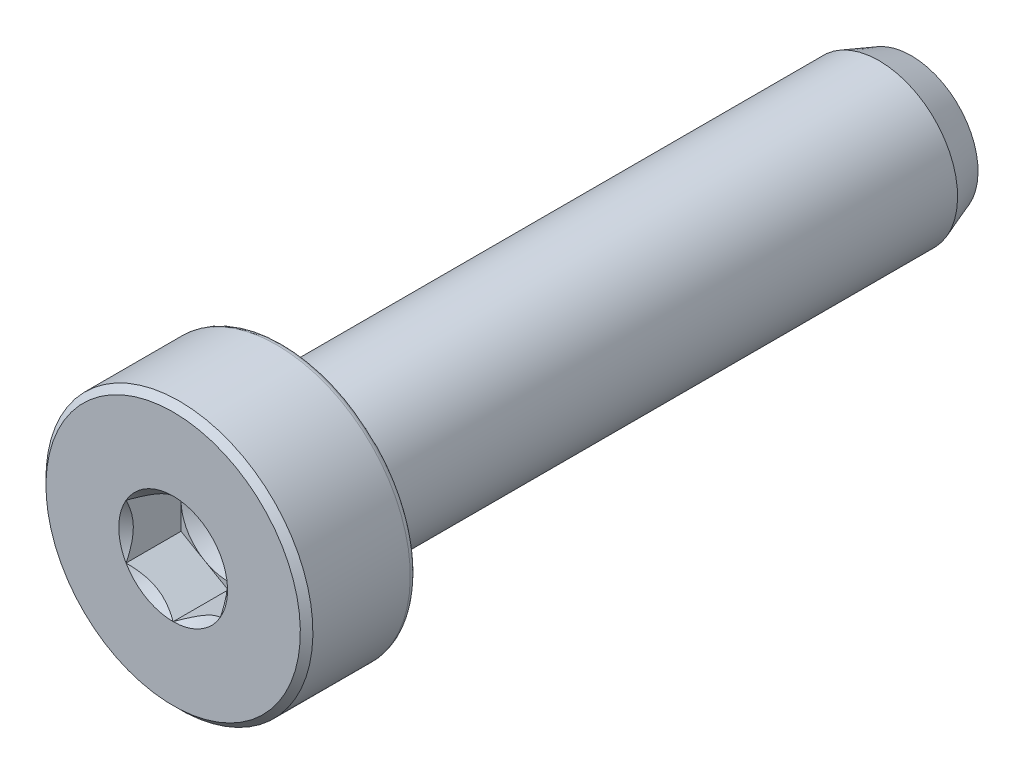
from build123d import *

# Parameters (mm, degrees)
SKETCH1_W          = 20
SKETCH1_H          = 2.5
SKETCH4_R          = 4.25
EXTRUDE1_DEPTH     = 3.5
CUT_EXTRUDE1_DEPTH = 1.75
SKETCH8_R          = 1.5
CUT_EXTRUDE5_DEPTH = 0.583333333
CUT_EXTRUDE5_DRAFT = -60


with BuildPart() as part:
    # Sketch1 → Revolve1 (revolve)
    with BuildSketch(Plane(origin=(0, 0, 0), x_dir=(0, 0, -1), z_dir=(1, 0, 0))):
        with Locations((10, 1.25)):
            Rectangle(SKETCH1_W, SKETCH1_H)
    revolve(axis=Axis((0, 0, 0), (0, 0, 1)))

    # Sketch3 → Cut-Revolve2 (revolve, cut)
    with BuildSketch(Plane(origin=(0, 0, 0), x_dir=(0, 0, -1), z_dir=(1, 0, 0))):
        Polygon((20, 2.127722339), (18.977175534, 2.5), (20, 2.5), align=None)
    revolve(axis=Axis((0, 0, -18.977175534), (0, 0, 1)), mode=Mode.SUBTRACT)

    # Sketch4 → Extrude1 (add)
    with BuildSketch(Plane.XY):
        Circle(SKETCH4_R)
    extrude(amount=EXTRUDE1_DEPTH)

    # Sketch10 → Cut-Revolve3 (revolve, cut)
    with BuildSketch(Plane(origin=(0, 0, 0), x_dir=(0, 0, -1), z_dir=(1, 0, 0))):
        with BuildLine():
            Line((-3.5, 4.05), (-3.3, 4.25))
            Line((-3.3, 4.25), (-0.2, 4.25))
            ThreePointArc((-0.2, 4.25), (-0.058578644, 4.191421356), (0, 4.05))
            Line((0, 4.05), (0.1, 4.05))
            Line((0.1, 4.05), (0.1, 4.35))
            Line((0.1, 4.35), (-3.5, 4.35))
            Line((-3.5, 4.35), (-3.5, 4.05))
        make_face()
    revolve(axis=Axis((0, 0, 3.5), (0, 0, 1)), mode=Mode.SUBTRACT)

    # Sketch6 → Cut-Extrude1 (cut)
    with BuildSketch(Plane.XY.offset(3.5)):
        Polygon((0, -1.732050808), (1.5, -0.866025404), (1.5, 0.866025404), (0, 1.732050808), (-1.5, 0.866025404), (-1.5, -0.866025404), align=None)
    extrude(amount=-CUT_EXTRUDE1_DEPTH, mode=Mode.SUBTRACT)

    # Cut-Extrude4 cone 1 section (on through the dimple's axis) → Cut-Extrude4 (revolve, cut)
    with BuildSketch(Plane(origin=(0, 0, 3.5), x_dir=(0, -1, 0), z_dir=(1, 0, 0))):
        Polygon((0, 0), (1.732050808, 0), (0, 1.732050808), align=None)
    revolve(axis=Axis((0, 0, 3.5), (0, 0, -1)), mode=Mode.SUBTRACT)


with BuildPart() as cut_extrude5_tool:
    # Sketch8 → Cut-Extrude5 (with draft: the straight prism first)
    with BuildSketch(Plane.XY.offset(1.75)):
        Circle(SKETCH8_R)
    extrude(amount=-CUT_EXTRUDE5_DEPTH)
    # Cut-Extrude5: the draft: its side faces are tilted about the plane it starts from
    cut_extrude5_sides = [cut_extrude5_tool.faces().sort_by_distance(p)[0] for p in [
        (-1.5, 0, 1.458333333),
    ]]
    draft(cut_extrude5_sides, Plane.XY.offset(1.75), CUT_EXTRUDE5_DRAFT)


with BuildPart() as part_1:
    add(part.part)

    # Cut-Extrude5: cut by cut_extrude5_tool
    add(cut_extrude5_tool.part, mode=Mode.SUBTRACT)


solid = part_1.part
